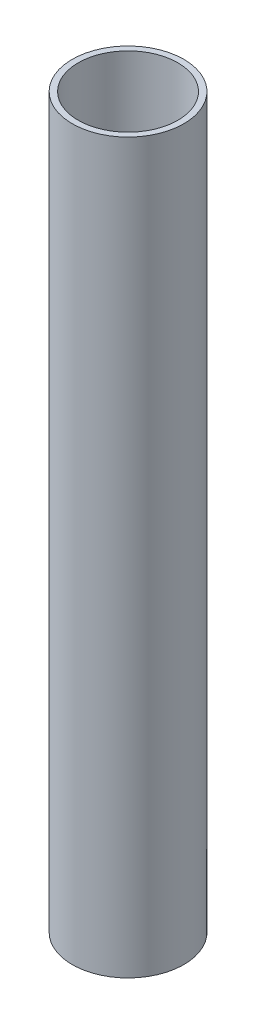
from build123d import *

# Parameters (mm, degrees)
SKETCH1_R           = 9.35
SKETCH1_R_2         = 8.35
BOSS_EXTRUDE1_DEPTH = 122


with BuildPart() as part:
    # Sketch1 → Boss-Extrude1 (new body)
    with BuildSketch(Plane(origin=(0, 0, 0), x_dir=(1, 0, 0), z_dir=(0, 1, 0))):
        with Locations(Location((0, 0, 0), (0, 0, 90))):
            Circle(SKETCH1_R)
        with Locations(Location((0, 0, 0), (0, 0, 90))):
            Circle(SKETCH1_R_2, mode=Mode.SUBTRACT)
    extrude(amount=BOSS_EXTRUDE1_DEPTH)


solid = part.part
